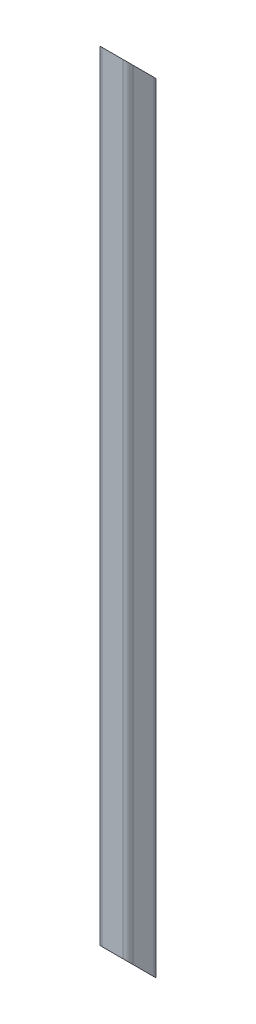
ISO-10303-21;
HEADER;
FILE_DESCRIPTION(('STEP AP214'),'2;1');
FILE_NAME('part.step','',(''),(''),'','','');
FILE_SCHEMA(('AUTOMOTIVE_DESIGN { 1 0 10303 214 1 1 1 1 }'));
ENDSEC;
DATA;
#1=APPLICATION_CONTEXT('core data for automotive mechanical design processes');
#2=APPLICATION_PROTOCOL_DEFINITION('international standard','automotive_design',2000,#1);
#3=PRODUCT_CONTEXT('',#1,'mechanical');
#4=PRODUCT('Part','Part','',(#3));
#5=PRODUCT_RELATED_PRODUCT_CATEGORY('part','',(#4));
#6=PRODUCT_DEFINITION_FORMATION('','',#4);
#7=PRODUCT_DEFINITION_CONTEXT('part definition',#1,'design');
#8=PRODUCT_DEFINITION('design','',#6,#7);
#9=PRODUCT_DEFINITION_SHAPE('','',#8);
#10=(LENGTH_UNIT() NAMED_UNIT(*) SI_UNIT(.MILLI.,.METRE.));
#11=(NAMED_UNIT(*) PLANE_ANGLE_UNIT() SI_UNIT($,.RADIAN.));
#12=(NAMED_UNIT(*) SI_UNIT($,.STERADIAN.) SOLID_ANGLE_UNIT());
#13=UNCERTAINTY_MEASURE_WITH_UNIT(LENGTH_MEASURE(1.E-05),#10,'distance_accuracy_value','');
#14=(GEOMETRIC_REPRESENTATION_CONTEXT(3) GLOBAL_UNCERTAINTY_ASSIGNED_CONTEXT((#13)) GLOBAL_UNIT_ASSIGNED_CONTEXT((#10,
#11,#12)) REPRESENTATION_CONTEXT('',''));
#15=CARTESIAN_POINT('',(0.,0.,0.));
#16=DIRECTION('',(0.,0.,1.));
#17=DIRECTION('',(1.,0.,0.));
#18=AXIS2_PLACEMENT_3D('',#15,#16,#17);
#19=CARTESIAN_POINT('',(-12.9743200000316,990.6,-12.9743199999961));
#20=DIRECTION('',(0.,-1.,0.));
#21=DIRECTION('',(0.,0.,-1.));
#22=AXIS2_PLACEMENT_3D('',#19,#20,#21);
#23=CYLINDRICAL_SURFACE('',#22,6.07568);
#24=DIRECTION('',(0.,-1.,0.));
#25=VECTOR('',#24,1.);
#26=CARTESIAN_POINT('',(-12.9743200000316,990.6,-19.049999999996));
#27=LINE('',#26,#25);
#28=CARTESIAN_POINT('',(-12.9743200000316,952.5,-19.05));
#29=VERTEX_POINT('',#28);
#30=CARTESIAN_POINT('',(-12.9743199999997,0.,-19.05));
#31=VERTEX_POINT('',#30);
#32=EDGE_CURVE('E219',#29,#31,#27,.T.);
#33=ORIENTED_EDGE('',*,*,#32,.T.);
#34=CARTESIAN_POINT('',(-12.9743200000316,6.07567999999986,-12.9743199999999));
#35=DIRECTION('',(0.,0.707106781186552,-0.707106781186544));
#36=DIRECTION('',(0.,-0.707106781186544,-0.707106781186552));
#37=AXIS2_PLACEMENT_3D('',#34,#35,#36);
#38=ELLIPSE('',#37,8.59230905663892,6.07568);
#39=CARTESIAN_POINT('',(-19.050000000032,6.07567999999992,-12.9743200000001));
#40=VERTEX_POINT('',#39);
#41=EDGE_CURVE('E286',#31,#40,#38,.T.);
#42=ORIENTED_EDGE('',*,*,#41,.T.);
#43=DIRECTION('',(0.,-1.,0.));
#44=VECTOR('',#43,1.);
#45=CARTESIAN_POINT('',(-19.050000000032,990.6,-12.9743199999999));
#46=LINE('',#45,#44);
#47=CARTESIAN_POINT('',(-19.050000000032,958.57568,-12.9743200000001));
#48=VERTEX_POINT('',#47);
#49=EDGE_CURVE('E231',#48,#40,#46,.T.);
#50=ORIENTED_EDGE('',*,*,#49,.F.);
#51=CARTESIAN_POINT('',(-12.9743200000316,958.57568,-12.9743199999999));
#52=DIRECTION('',(0.,-0.707106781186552,0.707106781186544));
#53=DIRECTION('',(0.,-0.707106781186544,-0.707106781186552));
#54=AXIS2_PLACEMENT_3D('',#51,#52,#53);
#55=ELLIPSE('',#54,8.59230905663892,6.07568);
#56=EDGE_CURVE('E260',#48,#29,#55,.T.);
#57=ORIENTED_EDGE('',*,*,#56,.T.);
#58=EDGE_LOOP('',(#33,#42,#50,#57));
#59=FACE_BOUND('',#58,.T.);
#60=ADVANCED_FACE('F80',(#59),#23,.T.);
#61=CARTESIAN_POINT('',(-19.050000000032,990.6,-12.9743199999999));
#62=DIRECTION('',(1.,0.,0.));
#63=DIRECTION('',(0.,0.,-1.));
#64=AXIS2_PLACEMENT_3D('',#61,#62,#63);
#65=PLANE('',#64);
#66=ORIENTED_EDGE('',*,*,#49,.T.);
#67=DIRECTION('',(0.,0.707106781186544,0.707106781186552));
#68=VECTOR('',#67,1.);
#69=CARTESIAN_POINT('',(-19.05,0.,-19.05));
#70=LINE('',#69,#68);
#71=CARTESIAN_POINT('',(-19.050000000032,32.0243200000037,12.9743199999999));
#72=VERTEX_POINT('',#71);
#73=EDGE_CURVE('E212',#40,#72,#70,.T.);
#74=ORIENTED_EDGE('',*,*,#73,.T.);
#75=DIRECTION('',(0.,-1.,0.));
#76=VECTOR('',#75,1.);
#77=CARTESIAN_POINT('',(-19.050000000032,990.6,12.9743200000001));
#78=LINE('',#77,#76);
#79=CARTESIAN_POINT('',(-19.050000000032,984.52432,12.9743200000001));
#80=VERTEX_POINT('',#79);
#81=EDGE_CURVE('E228',#80,#72,#78,.T.);
#82=ORIENTED_EDGE('',*,*,#81,.F.);
#83=DIRECTION('',(0.,-0.707106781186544,-0.707106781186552));
#84=VECTOR('',#83,1.);
#85=CARTESIAN_POINT('',(-19.050000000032,990.6,19.05));
#86=LINE('',#85,#84);
#87=EDGE_CURVE('E289',#80,#48,#86,.T.);
#88=ORIENTED_EDGE('',*,*,#87,.T.);
#89=EDGE_LOOP('',(#66,#74,#82,#88));
#90=FACE_BOUND('',#89,.T.);
#91=ADVANCED_FACE('F320',(#90),#65,.F.);
#92=CARTESIAN_POINT('',(-12.9743200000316,990.6,12.9743200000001));
#93=DIRECTION('',(0.,-1.,0.));
#94=DIRECTION('',(0.,0.,-1.));
#95=AXIS2_PLACEMENT_3D('',#92,#93,#94);
#96=CYLINDRICAL_SURFACE('',#95,6.07568);
#97=ORIENTED_EDGE('',*,*,#81,.T.);
#98=CARTESIAN_POINT('',(-12.9743200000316,32.0243199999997,12.9743199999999));
#99=DIRECTION('',(0.,0.707106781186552,-0.707106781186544));
#100=DIRECTION('',(0.,-0.707106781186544,-0.707106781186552));
#101=AXIS2_PLACEMENT_3D('',#98,#99,#100);
#102=ELLIPSE('',#101,8.59230905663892,6.07568);
#103=CARTESIAN_POINT('',(-12.9743200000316,38.0999999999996,19.05));
#104=VERTEX_POINT('',#103);
#105=EDGE_CURVE('E339',#72,#104,#102,.T.);
#106=ORIENTED_EDGE('',*,*,#105,.T.);
#107=DIRECTION('',(0.,-1.,0.));
#108=VECTOR('',#107,1.);
#109=CARTESIAN_POINT('',(-12.9743200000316,990.6,19.05));
#110=LINE('',#109,#108);
#111=CARTESIAN_POINT('',(-12.9743200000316,990.6,19.05));
#112=VERTEX_POINT('',#111);
#113=EDGE_CURVE('E225',#112,#104,#110,.T.);
#114=ORIENTED_EDGE('',*,*,#113,.F.);
#115=CARTESIAN_POINT('',(-12.9743200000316,984.52432,12.9743200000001));
#116=DIRECTION('',(0.,-0.707106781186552,0.707106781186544));
#117=DIRECTION('',(0.,-0.707106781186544,-0.707106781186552));
#118=AXIS2_PLACEMENT_3D('',#115,#116,#117);
#119=ELLIPSE('',#118,8.59230905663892,6.07568);
#120=EDGE_CURVE('E310',#112,#80,#119,.T.);
#121=ORIENTED_EDGE('',*,*,#120,.T.);
#122=EDGE_LOOP('',(#97,#106,#114,#121));
#123=FACE_BOUND('',#122,.T.);
#124=ADVANCED_FACE('F315',(#123),#96,.T.);
#125=CARTESIAN_POINT('',(-12.9743200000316,990.6,19.05));
#126=DIRECTION('',(0.,0.,-1.));
#127=DIRECTION('',(-1.,0.,0.));
#128=AXIS2_PLACEMENT_3D('',#125,#126,#127);
#129=PLANE('',#128);
#130=ORIENTED_EDGE('',*,*,#113,.T.);
#131=DIRECTION('',(1.,0.,0.));
#132=VECTOR('',#131,1.);
#133=CARTESIAN_POINT('',(-19.050000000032,38.1000000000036,19.05));
#134=LINE('',#133,#132);
#135=CARTESIAN_POINT('',(12.9743199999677,38.1000000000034,19.05));
#136=VERTEX_POINT('',#135);
#137=EDGE_CURVE('E321',#104,#136,#134,.T.);
#138=ORIENTED_EDGE('',*,*,#137,.T.);
#139=DIRECTION('',(0.,-1.,0.));
#140=VECTOR('',#139,1.);
#141=CARTESIAN_POINT('',(12.9743199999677,990.599999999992,19.05));
#142=LINE('',#141,#140);
#143=CARTESIAN_POINT('',(12.9743199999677,990.599999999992,19.05));
#144=VERTEX_POINT('',#143);
#145=EDGE_CURVE('E217',#144,#136,#142,.T.);
#146=ORIENTED_EDGE('',*,*,#145,.F.);
#147=DIRECTION('',(1.,0.,0.));
#148=VECTOR('',#147,1.);
#149=CARTESIAN_POINT('',(-12.9743200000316,990.6,19.05));
#150=LINE('',#149,#148);
#151=EDGE_CURVE('E278',#112,#144,#150,.T.);
#152=ORIENTED_EDGE('',*,*,#151,.F.);
#153=EDGE_LOOP('',(#130,#138,#146,#152));
#154=FACE_BOUND('',#153,.T.);
#155=ADVANCED_FACE('F345',(#154),#129,.F.);
#156=CARTESIAN_POINT('',(12.9743199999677,990.599999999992,12.9743199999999));
#157=DIRECTION('',(0.,-1.,0.));
#158=DIRECTION('',(0.,0.,-1.));
#159=AXIS2_PLACEMENT_3D('',#156,#157,#158);
#160=CYLINDRICAL_SURFACE('',#159,6.07568);
#161=ORIENTED_EDGE('',*,*,#145,.T.);
#162=CARTESIAN_POINT('',(12.9743199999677,32.0243200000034,12.9743199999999));
#163=DIRECTION('',(0.,0.707106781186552,-0.707106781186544));
#164=DIRECTION('',(0.,-0.707106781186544,-0.707106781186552));
#165=AXIS2_PLACEMENT_3D('',#162,#163,#164);
#166=ELLIPSE('',#165,8.59230905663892,6.07568);
#167=CARTESIAN_POINT('',(19.049999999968,32.0243200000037,12.9743200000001));
#168=VERTEX_POINT('',#167);
#169=EDGE_CURVE('E201',#136,#168,#166,.T.);
#170=ORIENTED_EDGE('',*,*,#169,.T.);
#171=DIRECTION('',(0.,-1.,0.));
#172=VECTOR('',#171,1.);
#173=CARTESIAN_POINT('',(19.049999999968,990.599999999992,12.9743199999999));
#174=LINE('',#173,#172);
#175=CARTESIAN_POINT('',(19.049999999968,984.524319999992,12.9743199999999));
#176=VERTEX_POINT('',#175);
#177=EDGE_CURVE('E211',#176,#168,#174,.T.);
#178=ORIENTED_EDGE('',*,*,#177,.F.);
#179=CARTESIAN_POINT('',(12.9743199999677,984.524319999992,12.9743199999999));
#180=DIRECTION('',(0.,-0.707106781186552,0.707106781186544));
#181=DIRECTION('',(0.,-0.707106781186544,-0.707106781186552));
#182=AXIS2_PLACEMENT_3D('',#179,#180,#181);
#183=ELLIPSE('',#182,8.59230905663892,6.07568);
#184=EDGE_CURVE('E307',#176,#144,#183,.T.);
#185=ORIENTED_EDGE('',*,*,#184,.T.);
#186=EDGE_LOOP('',(#161,#170,#178,#185));
#187=FACE_BOUND('',#186,.T.);
#188=ADVANCED_FACE('F342',(#187),#160,.T.);
#189=CARTESIAN_POINT('',(19.049999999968,990.599999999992,-12.9743200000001));
#190=DIRECTION('',(-1.,0.,0.));
#191=DIRECTION('',(0.,0.,1.));
#192=AXIS2_PLACEMENT_3D('',#189,#190,#191);
#193=PLANE('',#192);
#194=ORIENTED_EDGE('',*,*,#177,.T.);
#195=DIRECTION('',(0.,0.707106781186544,0.707106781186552));
#196=VECTOR('',#195,1.);
#197=CARTESIAN_POINT('',(19.05,0.,-19.05));
#198=LINE('',#197,#196);
#199=CARTESIAN_POINT('',(19.049999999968,6.07568000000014,-12.9743200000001));
#200=VERTEX_POINT('',#199);
#201=EDGE_CURVE('E193',#200,#168,#198,.T.);
#202=ORIENTED_EDGE('',*,*,#201,.F.);
#203=DIRECTION('',(0.,-1.,0.));
#204=VECTOR('',#203,1.);
#205=CARTESIAN_POINT('',(19.049999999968,990.599999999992,-12.9743200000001));
#206=LINE('',#205,#204);
#207=CARTESIAN_POINT('',(19.049999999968,958.575679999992,-12.9743199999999));
#208=VERTEX_POINT('',#207);
#209=EDGE_CURVE('E209',#208,#200,#206,.T.);
#210=ORIENTED_EDGE('',*,*,#209,.F.);
#211=DIRECTION('',(0.,-0.707106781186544,-0.707106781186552));
#212=VECTOR('',#211,1.);
#213=CARTESIAN_POINT('',(19.049999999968,990.599999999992,19.05));
#214=LINE('',#213,#212);
#215=EDGE_CURVE('E292',#176,#208,#214,.T.);
#216=ORIENTED_EDGE('',*,*,#215,.F.);
#217=EDGE_LOOP('',(#194,#202,#210,#216));
#218=FACE_BOUND('',#217,.T.);
#219=ADVANCED_FACE('F207',(#218),#193,.F.);
#220=CARTESIAN_POINT('',(12.9743199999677,990.599999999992,-12.9743200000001));
#221=DIRECTION('',(0.,-1.,0.));
#222=DIRECTION('',(0.,0.,-1.));
#223=AXIS2_PLACEMENT_3D('',#220,#221,#222);
#224=CYLINDRICAL_SURFACE('',#223,6.07568);
#225=ORIENTED_EDGE('',*,*,#209,.T.);
#226=CARTESIAN_POINT('',(12.9743199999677,6.07568000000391,-12.9743200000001));
#227=DIRECTION('',(0.,0.707106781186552,-0.707106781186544));
#228=DIRECTION('',(0.,-0.707106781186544,-0.707106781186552));
#229=AXIS2_PLACEMENT_3D('',#226,#227,#228);
#230=ELLIPSE('',#229,8.59230905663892,6.07568);
#231=CARTESIAN_POINT('',(12.9743199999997,1.66533453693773E-13,-19.05));
#232=VERTEX_POINT('',#231);
#233=EDGE_CURVE('E190',#200,#232,#230,.T.);
#234=ORIENTED_EDGE('',*,*,#233,.T.);
#235=DIRECTION('',(0.,-1.,0.));
#236=VECTOR('',#235,1.);
#237=CARTESIAN_POINT('',(12.9743199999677,990.599999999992,-19.05));
#238=LINE('',#237,#236);
#239=CARTESIAN_POINT('',(12.9743199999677,952.499999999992,-19.05));
#240=VERTEX_POINT('',#239);
#241=EDGE_CURVE('E215',#240,#232,#238,.T.);
#242=ORIENTED_EDGE('',*,*,#241,.F.);
#243=CARTESIAN_POINT('',(12.9743199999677,958.575679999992,-12.9743199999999));
#244=DIRECTION('',(0.,-0.707106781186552,0.707106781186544));
#245=DIRECTION('',(0.,-0.707106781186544,-0.707106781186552));
#246=AXIS2_PLACEMENT_3D('',#243,#244,#245);
#247=ELLIPSE('',#246,8.59230905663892,6.07568);
#248=EDGE_CURVE('E101',#240,#208,#247,.T.);
#249=ORIENTED_EDGE('',*,*,#248,.T.);
#250=EDGE_LOOP('',(#225,#234,#242,#249));
#251=FACE_BOUND('',#250,.T.);
#252=ADVANCED_FACE('F214',(#251),#224,.T.);
#253=CARTESIAN_POINT('',(-12.9743200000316,990.6,-19.049999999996));
#254=DIRECTION('',(0.,0.,1.));
#255=DIRECTION('',(1.,0.,0.));
#256=AXIS2_PLACEMENT_3D('',#253,#254,#255);
#257=PLANE('',#256);
#258=ORIENTED_EDGE('',*,*,#32,.F.);
#259=DIRECTION('',(1.,0.,0.));
#260=VECTOR('',#259,1.);
#261=CARTESIAN_POINT('',(-19.050000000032,952.5,-19.05));
#262=LINE('',#261,#260);
#263=EDGE_CURVE('E253',#29,#240,#262,.T.);
#264=ORIENTED_EDGE('',*,*,#263,.T.);
#265=ORIENTED_EDGE('',*,*,#241,.T.);
#266=DIRECTION('',(-1.,0.,0.));
#267=VECTOR('',#266,1.);
#268=CARTESIAN_POINT('',(-12.9743199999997,0.,-19.05));
#269=LINE('',#268,#267);
#270=EDGE_CURVE('E196',#232,#31,#269,.T.);
#271=ORIENTED_EDGE('',*,*,#270,.T.);
#272=EDGE_LOOP('',(#258,#264,#265,#271));
#273=FACE_BOUND('',#272,.T.);
#274=ADVANCED_FACE('F288',(#273),#257,.F.);
#275=CARTESIAN_POINT('',(-12.9743200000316,990.6,-12.9743199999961));
#276=DIRECTION('',(0.,-1.,0.));
#277=DIRECTION('',(0.,0.,-1.));
#278=AXIS2_PLACEMENT_3D('',#275,#276,#277);
#279=CYLINDRICAL_SURFACE('',#278,3.03784);
#280=CARTESIAN_POINT('',(-12.9743200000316,6.07567999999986,-12.9743199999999));
#281=DIRECTION('',(0.,0.707106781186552,-0.707106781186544));
#282=DIRECTION('',(0.,-0.707106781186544,-0.707106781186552));
#283=AXIS2_PLACEMENT_3D('',#280,#281,#282);
#284=ELLIPSE('',#283,4.29615452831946,3.03784);
#285=CARTESIAN_POINT('',(-12.9743199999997,3.03784000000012,-16.0121599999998));
#286=VERTEX_POINT('',#285);
#287=CARTESIAN_POINT('',(-16.0121600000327,6.07567999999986,-12.9743199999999));
#288=VERTEX_POINT('',#287);
#289=EDGE_CURVE('E202',#286,#288,#284,.T.);
#290=ORIENTED_EDGE('',*,*,#289,.F.);
#291=DIRECTION('',(0.,-1.,0.));
#292=VECTOR('',#291,1.);
#293=CARTESIAN_POINT('',(-12.9743200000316,990.6,-16.0121599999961));
#294=LINE('',#293,#292);
#295=CARTESIAN_POINT('',(-12.9743200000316,955.53784,-16.0121599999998));
#296=VERTEX_POINT('',#295);
#297=EDGE_CURVE('E256',#296,#286,#294,.T.);
#298=ORIENTED_EDGE('',*,*,#297,.F.);
#299=CARTESIAN_POINT('',(-12.9743200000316,958.57568,-12.9743199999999));
#300=DIRECTION('',(0.,-0.707106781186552,0.707106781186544));
#301=DIRECTION('',(0.,-0.707106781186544,-0.707106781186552));
#302=AXIS2_PLACEMENT_3D('',#299,#300,#301);
#303=ELLIPSE('',#302,4.29615452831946,3.03784);
#304=CARTESIAN_POINT('',(-16.0121600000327,958.57568,-12.9743199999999));
#305=VERTEX_POINT('',#304);
#306=EDGE_CURVE('E240',#305,#296,#303,.T.);
#307=ORIENTED_EDGE('',*,*,#306,.F.);
#308=DIRECTION('',(0.,-1.,0.));
#309=VECTOR('',#308,1.);
#310=CARTESIAN_POINT('',(-16.0121600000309,990.6,-12.9743199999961));
#311=LINE('',#310,#309);
#312=EDGE_CURVE('E275',#305,#288,#311,.T.);
#313=ORIENTED_EDGE('',*,*,#312,.T.);
#314=EDGE_LOOP('',(#290,#298,#307,#313));
#315=FACE_BOUND('',#314,.T.);
#316=ADVANCED_FACE('F399',(#315),#279,.F.);
#317=CARTESIAN_POINT('',(-16.0121600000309,990.6,-12.9743199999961));
#318=DIRECTION('',(1.,0.,0.));
#319=DIRECTION('',(0.,0.,-1.));
#320=AXIS2_PLACEMENT_3D('',#317,#318,#319);
#321=PLANE('',#320);
#322=DIRECTION('',(0.,0.707106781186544,0.707106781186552));
#323=VECTOR('',#322,1.);
#324=CARTESIAN_POINT('',(-16.0121600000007,498.337839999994,479.287839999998));
#325=LINE('',#324,#323);
#326=CARTESIAN_POINT('',(-16.0121600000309,32.0243199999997,12.9743199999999));
#327=VERTEX_POINT('',#326);
#328=EDGE_CURVE('E335',#288,#327,#325,.T.);
#329=ORIENTED_EDGE('',*,*,#328,.F.);
#330=ORIENTED_EDGE('',*,*,#312,.F.);
#331=DIRECTION('',(0.,-0.707106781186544,-0.707106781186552));
#332=VECTOR('',#331,1.);
#333=CARTESIAN_POINT('',(-16.0121600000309,974.58784,3.03784000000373));
#334=LINE('',#333,#332);
#335=CARTESIAN_POINT('',(-16.0121600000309,984.52432,12.9743200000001));
#336=VERTEX_POINT('',#335);
#337=EDGE_CURVE('E303',#336,#305,#334,.T.);
#338=ORIENTED_EDGE('',*,*,#337,.F.);
#339=DIRECTION('',(0.,-1.,0.));
#340=VECTOR('',#339,1.);
#341=CARTESIAN_POINT('',(-16.0121600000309,990.6,12.9743200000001));
#342=LINE('',#341,#340);
#343=EDGE_CURVE('E272',#336,#327,#342,.T.);
#344=ORIENTED_EDGE('',*,*,#343,.T.);
#345=EDGE_LOOP('',(#329,#330,#338,#344));
#346=FACE_BOUND('',#345,.T.);
#347=ADVANCED_FACE('F408',(#346),#321,.T.);
#348=CARTESIAN_POINT('',(-12.9743200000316,990.6,12.9743200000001));
#349=DIRECTION('',(0.,-1.,0.));
#350=DIRECTION('',(0.,0.,-1.));
#351=AXIS2_PLACEMENT_3D('',#348,#349,#350);
#352=CYLINDRICAL_SURFACE('',#351,3.03784);
#353=CARTESIAN_POINT('',(-12.9743200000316,32.0243199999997,12.9743199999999));
#354=DIRECTION('',(0.,0.707106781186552,-0.707106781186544));
#355=DIRECTION('',(0.,-0.707106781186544,-0.707106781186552));
#356=AXIS2_PLACEMENT_3D('',#353,#354,#355);
#357=ELLIPSE('',#356,4.29615452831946,3.03784);
#358=CARTESIAN_POINT('',(-12.9743200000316,35.0621599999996,16.0121600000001));
#359=VERTEX_POINT('',#358);
#360=EDGE_CURVE('E333',#327,#359,#357,.T.);
#361=ORIENTED_EDGE('',*,*,#360,.F.);
#362=ORIENTED_EDGE('',*,*,#343,.F.);
#363=CARTESIAN_POINT('',(-12.9743200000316,984.52432,12.9743200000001));
#364=DIRECTION('',(0.,-0.707106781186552,0.707106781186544));
#365=DIRECTION('',(0.,-0.707106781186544,-0.707106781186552));
#366=AXIS2_PLACEMENT_3D('',#363,#364,#365);
#367=ELLIPSE('',#366,4.29615452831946,3.03784);
#368=CARTESIAN_POINT('',(-12.9743200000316,987.56216,16.0121600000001));
#369=VERTEX_POINT('',#368);
#370=EDGE_CURVE('E301',#369,#336,#367,.T.);
#371=ORIENTED_EDGE('',*,*,#370,.F.);
#372=DIRECTION('',(0.,-1.,0.));
#373=VECTOR('',#372,1.);
#374=CARTESIAN_POINT('',(-12.9743200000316,990.6,16.0121600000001));
#375=LINE('',#374,#373);
#376=EDGE_CURVE('E269',#369,#359,#375,.T.);
#377=ORIENTED_EDGE('',*,*,#376,.T.);
#378=EDGE_LOOP('',(#361,#362,#371,#377));
#379=FACE_BOUND('',#378,.T.);
#380=ADVANCED_FACE('F418',(#379),#352,.F.);
#381=CARTESIAN_POINT('',(-12.9743200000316,990.6,16.0121600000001));
#382=DIRECTION('',(0.,0.,-1.));
#383=DIRECTION('',(-1.,0.,0.));
#384=AXIS2_PLACEMENT_3D('',#381,#382,#383);
#385=PLANE('',#384);
#386=DIRECTION('',(1.,0.,0.));
#387=VECTOR('',#386,1.);
#388=CARTESIAN_POINT('',(-12.9743200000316,35.0621599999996,16.0121600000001));
#389=LINE('',#388,#387);
#390=CARTESIAN_POINT('',(12.9743199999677,35.0621600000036,16.0121599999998));
#391=VERTEX_POINT('',#390);
#392=EDGE_CURVE('E331',#359,#391,#389,.T.);
#393=ORIENTED_EDGE('',*,*,#392,.F.);
#394=ORIENTED_EDGE('',*,*,#376,.F.);
#395=DIRECTION('',(-1.,0.,0.));
#396=VECTOR('',#395,1.);
#397=CARTESIAN_POINT('',(-12.9743200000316,987.56216,16.0121600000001));
#398=LINE('',#397,#396);
#399=CARTESIAN_POINT('',(12.9743199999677,987.562159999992,16.0121599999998));
#400=VERTEX_POINT('',#399);
#401=EDGE_CURVE('E299',#400,#369,#398,.T.);
#402=ORIENTED_EDGE('',*,*,#401,.F.);
#403=DIRECTION('',(0.,-1.,0.));
#404=VECTOR('',#403,1.);
#405=CARTESIAN_POINT('',(12.9743199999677,990.599999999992,16.0121599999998));
#406=LINE('',#405,#404);
#407=EDGE_CURVE('E266',#400,#391,#406,.T.);
#408=ORIENTED_EDGE('',*,*,#407,.T.);
#409=EDGE_LOOP('',(#393,#394,#402,#408));
#410=FACE_BOUND('',#409,.T.);
#411=ADVANCED_FACE('F428',(#410),#385,.T.);
#412=CARTESIAN_POINT('',(12.9743199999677,990.599999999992,12.9743199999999));
#413=DIRECTION('',(0.,-1.,0.));
#414=DIRECTION('',(0.,0.,-1.));
#415=AXIS2_PLACEMENT_3D('',#412,#413,#414);
#416=CYLINDRICAL_SURFACE('',#415,3.03784);
#417=CARTESIAN_POINT('',(12.9743199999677,32.0243200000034,12.9743199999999));
#418=DIRECTION('',(0.,0.707106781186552,-0.707106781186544));
#419=DIRECTION('',(0.,-0.707106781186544,-0.707106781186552));
#420=AXIS2_PLACEMENT_3D('',#417,#418,#419);
#421=ELLIPSE('',#420,4.29615452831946,3.03784);
#422=CARTESIAN_POINT('',(16.0121599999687,32.0243200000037,12.9743200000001));
#423=VERTEX_POINT('',#422);
#424=EDGE_CURVE('E329',#391,#423,#421,.T.);
#425=ORIENTED_EDGE('',*,*,#424,.F.);
#426=ORIENTED_EDGE('',*,*,#407,.F.);
#427=CARTESIAN_POINT('',(12.9743199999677,984.524319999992,12.9743199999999));
#428=DIRECTION('',(0.,-0.707106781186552,0.707106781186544));
#429=DIRECTION('',(0.,-0.707106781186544,-0.707106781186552));
#430=AXIS2_PLACEMENT_3D('',#427,#428,#429);
#431=ELLIPSE('',#430,4.29615452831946,3.03784);
#432=CARTESIAN_POINT('',(16.0121599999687,984.524319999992,12.9743199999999));
#433=VERTEX_POINT('',#432);
#434=EDGE_CURVE('E297',#433,#400,#431,.T.);
#435=ORIENTED_EDGE('',*,*,#434,.F.);
#436=DIRECTION('',(0.,-1.,0.));
#437=VECTOR('',#436,1.);
#438=CARTESIAN_POINT('',(16.0121599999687,990.599999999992,12.9743199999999));
#439=LINE('',#438,#437);
#440=EDGE_CURVE('E258',#433,#423,#439,.T.);
#441=ORIENTED_EDGE('',*,*,#440,.T.);
#442=EDGE_LOOP('',(#425,#426,#435,#441));
#443=FACE_BOUND('',#442,.T.);
#444=ADVANCED_FACE('F438',(#443),#416,.F.);
#445=CARTESIAN_POINT('',(16.0121599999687,990.599999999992,-12.9743200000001));
#446=DIRECTION('',(-1.,0.,0.));
#447=DIRECTION('',(0.,0.,1.));
#448=AXIS2_PLACEMENT_3D('',#445,#446,#447);
#449=PLANE('',#448);
#450=DIRECTION('',(0.,-0.707106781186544,-0.707106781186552));
#451=VECTOR('',#450,1.);
#452=CARTESIAN_POINT('',(16.0121600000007,498.337839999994,479.28784));
#453=LINE('',#452,#451);
#454=CARTESIAN_POINT('',(16.0121599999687,6.07568000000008,-12.9743200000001));
#455=VERTEX_POINT('',#454);
#456=EDGE_CURVE('E327',#423,#455,#453,.T.);
#457=ORIENTED_EDGE('',*,*,#456,.F.);
#458=ORIENTED_EDGE('',*,*,#440,.F.);
#459=DIRECTION('',(0.,0.707106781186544,0.707106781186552));
#460=VECTOR('',#459,1.);
#461=CARTESIAN_POINT('',(16.0121599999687,974.587839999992,3.03783999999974));
#462=LINE('',#461,#460);
#463=CARTESIAN_POINT('',(16.0121599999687,958.575679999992,-12.9743199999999));
#464=VERTEX_POINT('',#463);
#465=EDGE_CURVE('E252',#464,#433,#462,.T.);
#466=ORIENTED_EDGE('',*,*,#465,.F.);
#467=DIRECTION('',(0.,-1.,0.));
#468=VECTOR('',#467,1.);
#469=CARTESIAN_POINT('',(16.0121599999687,990.599999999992,-12.9743200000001));
#470=LINE('',#469,#468);
#471=EDGE_CURVE('E251',#464,#455,#470,.T.);
#472=ORIENTED_EDGE('',*,*,#471,.T.);
#473=EDGE_LOOP('',(#457,#458,#466,#472));
#474=FACE_BOUND('',#473,.T.);
#475=ADVANCED_FACE('F448',(#474),#449,.T.);
#476=CARTESIAN_POINT('',(12.9743199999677,990.599999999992,-12.9743200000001));
#477=DIRECTION('',(0.,-1.,0.));
#478=DIRECTION('',(0.,0.,-1.));
#479=AXIS2_PLACEMENT_3D('',#476,#477,#478);
#480=CYLINDRICAL_SURFACE('',#479,3.03784);
#481=CARTESIAN_POINT('',(12.9743199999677,6.07568000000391,-12.9743200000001));
#482=DIRECTION('',(0.,0.707106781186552,-0.707106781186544));
#483=DIRECTION('',(0.,-0.707106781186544,-0.707106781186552));
#484=AXIS2_PLACEMENT_3D('',#481,#482,#483);
#485=ELLIPSE('',#484,4.29615452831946,3.03784);
#486=CARTESIAN_POINT('',(12.9743199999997,3.03784000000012,-16.0121600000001));
#487=VERTEX_POINT('',#486);
#488=EDGE_CURVE('E93',#455,#487,#485,.T.);
#489=ORIENTED_EDGE('',*,*,#488,.F.);
#490=ORIENTED_EDGE('',*,*,#471,.F.);
#491=CARTESIAN_POINT('',(12.9743199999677,958.575679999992,-12.9743199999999));
#492=DIRECTION('',(0.,-0.707106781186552,0.707106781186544));
#493=DIRECTION('',(0.,-0.707106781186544,-0.707106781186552));
#494=AXIS2_PLACEMENT_3D('',#491,#492,#493);
#495=ELLIPSE('',#494,4.29615452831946,3.03784);
#496=CARTESIAN_POINT('',(12.9743199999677,955.537839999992,-16.0121600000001));
#497=VERTEX_POINT('',#496);
#498=EDGE_CURVE('E237',#497,#464,#495,.T.);
#499=ORIENTED_EDGE('',*,*,#498,.F.);
#500=DIRECTION('',(0.,-1.,0.));
#501=VECTOR('',#500,1.);
#502=CARTESIAN_POINT('',(12.9743199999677,990.599999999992,-16.0121600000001));
#503=LINE('',#502,#501);
#504=EDGE_CURVE('E249',#497,#487,#503,.T.);
#505=ORIENTED_EDGE('',*,*,#504,.T.);
#506=EDGE_LOOP('',(#489,#490,#499,#505));
#507=FACE_BOUND('',#506,.T.);
#508=ADVANCED_FACE('F248',(#507),#480,.F.);
#509=CARTESIAN_POINT('',(-12.9743200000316,990.6,-16.0121599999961));
#510=DIRECTION('',(0.,0.,1.));
#511=DIRECTION('',(1.,0.,0.));
#512=AXIS2_PLACEMENT_3D('',#509,#510,#511);
#513=PLANE('',#512);
#514=DIRECTION('',(-1.,0.,0.));
#515=VECTOR('',#514,1.);
#516=CARTESIAN_POINT('',(-12.9743199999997,3.03784000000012,-16.0121599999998));
#517=LINE('',#516,#515);
#518=EDGE_CURVE('E12',#487,#286,#517,.T.);
#519=ORIENTED_EDGE('',*,*,#518,.F.);
#520=ORIENTED_EDGE('',*,*,#504,.F.);
#521=DIRECTION('',(1.,0.,0.));
#522=VECTOR('',#521,1.);
#523=CARTESIAN_POINT('',(-12.9743200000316,955.53784,-16.0121599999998));
#524=LINE('',#523,#522);
#525=EDGE_CURVE('E87',#296,#497,#524,.T.);
#526=ORIENTED_EDGE('',*,*,#525,.F.);
#527=ORIENTED_EDGE('',*,*,#297,.T.);
#528=EDGE_LOOP('',(#519,#520,#526,#527));
#529=FACE_BOUND('',#528,.T.);
#530=ADVANCED_FACE('F255',(#529),#513,.T.);
#531=CARTESIAN_POINT('',(-19.050000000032,990.6,19.05));
#532=DIRECTION('',(0.,-0.707106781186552,0.707106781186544));
#533=DIRECTION('',(0.,-0.707106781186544,-0.707106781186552));
#534=AXIS2_PLACEMENT_3D('',#531,#532,#533);
#535=PLANE('',#534);
#536=ORIENTED_EDGE('',*,*,#306,.T.);
#537=ORIENTED_EDGE('',*,*,#525,.T.);
#538=ORIENTED_EDGE('',*,*,#498,.T.);
#539=ORIENTED_EDGE('',*,*,#465,.T.);
#540=ORIENTED_EDGE('',*,*,#434,.T.);
#541=ORIENTED_EDGE('',*,*,#401,.T.);
#542=ORIENTED_EDGE('',*,*,#370,.T.);
#543=ORIENTED_EDGE('',*,*,#337,.T.);
#544=EDGE_LOOP('',(#536,#537,#538,#539,#540,#541,#542,#543));
#545=FACE_BOUND('',#544,.T.);
#546=ORIENTED_EDGE('',*,*,#87,.F.);
#547=ORIENTED_EDGE('',*,*,#120,.F.);
#548=ORIENTED_EDGE('',*,*,#151,.T.);
#549=ORIENTED_EDGE('',*,*,#184,.F.);
#550=ORIENTED_EDGE('',*,*,#215,.T.);
#551=ORIENTED_EDGE('',*,*,#248,.F.);
#552=ORIENTED_EDGE('',*,*,#263,.F.);
#553=ORIENTED_EDGE('',*,*,#56,.F.);
#554=EDGE_LOOP('',(#546,#547,#548,#549,#550,#551,#552,#553));
#555=FACE_BOUND('',#554,.T.);
#556=ADVANCED_FACE('F236',(#545,#555),#535,.F.);
#557=CARTESIAN_POINT('',(-19.05,0.,-19.05));
#558=DIRECTION('',(0.,0.707106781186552,-0.707106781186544));
#559=DIRECTION('',(0.,0.707106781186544,0.707106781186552));
#560=AXIS2_PLACEMENT_3D('',#557,#558,#559);
#561=PLANE('',#560);
#562=ORIENTED_EDGE('',*,*,#289,.T.);
#563=ORIENTED_EDGE('',*,*,#328,.T.);
#564=ORIENTED_EDGE('',*,*,#360,.T.);
#565=ORIENTED_EDGE('',*,*,#392,.T.);
#566=ORIENTED_EDGE('',*,*,#424,.T.);
#567=ORIENTED_EDGE('',*,*,#456,.T.);
#568=ORIENTED_EDGE('',*,*,#488,.T.);
#569=ORIENTED_EDGE('',*,*,#518,.T.);
#570=EDGE_LOOP('',(#562,#563,#564,#565,#566,#567,#568,#569));
#571=FACE_BOUND('',#570,.T.);
#572=ORIENTED_EDGE('',*,*,#270,.F.);
#573=ORIENTED_EDGE('',*,*,#233,.F.);
#574=ORIENTED_EDGE('',*,*,#201,.T.);
#575=ORIENTED_EDGE('',*,*,#169,.F.);
#576=ORIENTED_EDGE('',*,*,#137,.F.);
#577=ORIENTED_EDGE('',*,*,#105,.F.);
#578=ORIENTED_EDGE('',*,*,#73,.F.);
#579=ORIENTED_EDGE('',*,*,#41,.F.);
#580=EDGE_LOOP('',(#572,#573,#574,#575,#576,#577,#578,#579));
#581=FACE_BOUND('',#580,.T.);
#582=ADVANCED_FACE('F192',(#571,#581),#561,.F.);
#583=CLOSED_SHELL('',(#60,#91,#124,#155,#188,#219,#252,#274,#316,#347,#380,#411,#444,#475,#508,
#530,#556,#582));
#584=MANIFOLD_SOLID_BREP('B2',#583);
#585=ADVANCED_BREP_SHAPE_REPRESENTATION('',(#18,#584),#14);
#586=SHAPE_DEFINITION_REPRESENTATION(#9,#585);
ENDSEC;
END-ISO-10303-21;
